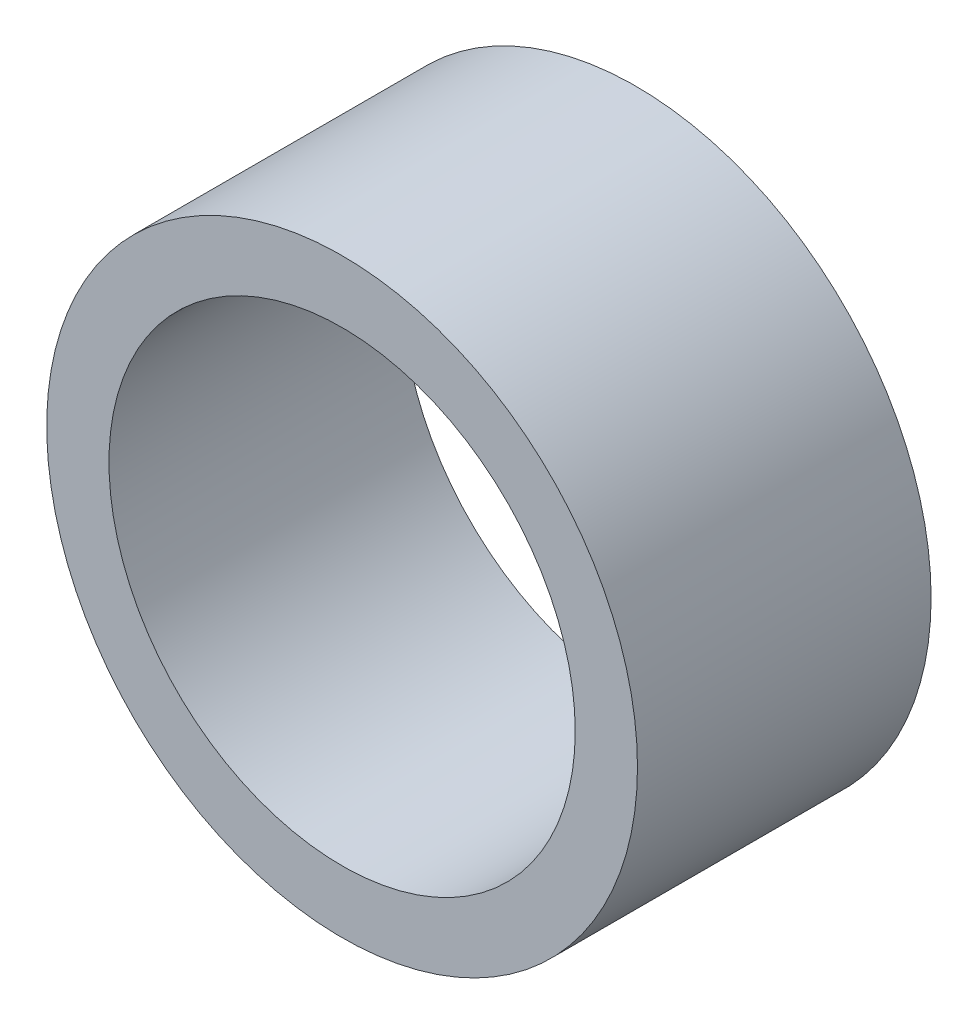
ISO-10303-21;
HEADER;
FILE_DESCRIPTION(('STEP AP214'),'2;1');
FILE_NAME('part.step','',(''),(''),'','','');
FILE_SCHEMA(('AUTOMOTIVE_DESIGN { 1 0 10303 214 1 1 1 1 }'));
ENDSEC;
DATA;
#1=APPLICATION_CONTEXT('core data for automotive mechanical design processes');
#2=APPLICATION_PROTOCOL_DEFINITION('international standard','automotive_design',2000,#1);
#3=PRODUCT_CONTEXT('',#1,'mechanical');
#4=PRODUCT('Part','Part','',(#3));
#5=PRODUCT_RELATED_PRODUCT_CATEGORY('part','',(#4));
#6=PRODUCT_DEFINITION_FORMATION('','',#4);
#7=PRODUCT_DEFINITION_CONTEXT('part definition',#1,'design');
#8=PRODUCT_DEFINITION('design','',#6,#7);
#9=PRODUCT_DEFINITION_SHAPE('','',#8);
#10=(LENGTH_UNIT() NAMED_UNIT(*) SI_UNIT(.MILLI.,.METRE.));
#11=(NAMED_UNIT(*) PLANE_ANGLE_UNIT() SI_UNIT($,.RADIAN.));
#12=(NAMED_UNIT(*) SI_UNIT($,.STERADIAN.) SOLID_ANGLE_UNIT());
#13=UNCERTAINTY_MEASURE_WITH_UNIT(LENGTH_MEASURE(1.E-05),#10,'distance_accuracy_value','');
#14=(GEOMETRIC_REPRESENTATION_CONTEXT(3) GLOBAL_UNCERTAINTY_ASSIGNED_CONTEXT((#13)) GLOBAL_UNIT_ASSIGNED_CONTEXT((#10,
#11,#12)) REPRESENTATION_CONTEXT('',''));
#15=CARTESIAN_POINT('',(0.,0.,0.));
#16=DIRECTION('',(0.,0.,1.));
#17=DIRECTION('',(1.,0.,0.));
#18=AXIS2_PLACEMENT_3D('',#15,#16,#17);
#19=CARTESIAN_POINT('',(0.,0.,961.349421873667));
#20=DIRECTION('',(0.,0.,-1.));
#21=DIRECTION('',(-1.,0.,0.));
#22=AXIS2_PLACEMENT_3D('',#19,#20,#21);
#23=CYLINDRICAL_SURFACE('',#22,251.5);
#24=CARTESIAN_POINT('',(0.,0.,0.));
#25=DIRECTION('',(0.,0.,1.));
#26=DIRECTION('',(1.,0.,0.));
#27=AXIS2_PLACEMENT_3D('',#24,#25,#26);
#28=CIRCLE('',#27,251.5);
#29=CARTESIAN_POINT('',(251.5,0.,0.));
#30=VERTEX_POINT('',#29);
#31=EDGE_CURVE('E46',#30,#30,#28,.T.);
#32=ORIENTED_EDGE('',*,*,#31,.T.);
#33=EDGE_LOOP('',(#32));
#34=FACE_BOUND('',#33,.T.);
#35=CARTESIAN_POINT('',(0.,0.,250.));
#36=DIRECTION('',(0.,0.,1.));
#37=DIRECTION('',(1.,0.,0.));
#38=AXIS2_PLACEMENT_3D('',#35,#36,#37);
#39=CIRCLE('',#38,251.5);
#40=CARTESIAN_POINT('',(251.5,0.,250.));
#41=VERTEX_POINT('',#40);
#42=EDGE_CURVE('E10',#41,#41,#39,.T.);
#43=ORIENTED_EDGE('',*,*,#42,.F.);
#44=EDGE_LOOP('',(#43));
#45=FACE_BOUND('',#44,.T.);
#46=ADVANCED_FACE('F39',(#34,#45),#23,.T.);
#47=CARTESIAN_POINT('',(0.,0.,0.));
#48=DIRECTION('',(0.,0.,1.));
#49=DIRECTION('',(1.,0.,0.));
#50=AXIS2_PLACEMENT_3D('',#47,#48,#49);
#51=PLANE('',#50);
#52=ORIENTED_EDGE('',*,*,#31,.F.);
#53=EDGE_LOOP('',(#52));
#54=FACE_BOUND('',#53,.T.);
#55=CARTESIAN_POINT('',(0.,0.,0.));
#56=DIRECTION('',(0.,0.,1.));
#57=DIRECTION('',(1.,0.,0.));
#58=AXIS2_PLACEMENT_3D('',#55,#56,#57);
#59=CIRCLE('',#58,198.5);
#60=CARTESIAN_POINT('',(198.5,0.,0.));
#61=VERTEX_POINT('',#60);
#62=EDGE_CURVE('E51',#61,#61,#59,.T.);
#63=ORIENTED_EDGE('',*,*,#62,.T.);
#64=EDGE_LOOP('',(#63));
#65=FACE_BOUND('',#64,.T.);
#66=ADVANCED_FACE('F67',(#54,#65),#51,.F.);
#67=CARTESIAN_POINT('',(0.,0.,961.349421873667));
#68=DIRECTION('',(0.,0.,-1.));
#69=DIRECTION('',(-1.,0.,0.));
#70=AXIS2_PLACEMENT_3D('',#67,#68,#69);
#71=CYLINDRICAL_SURFACE('',#70,198.5);
#72=ORIENTED_EDGE('',*,*,#62,.F.);
#73=EDGE_LOOP('',(#72));
#74=FACE_BOUND('',#73,.T.);
#75=CARTESIAN_POINT('',(0.,0.,250.));
#76=DIRECTION('',(0.,0.,1.));
#77=DIRECTION('',(1.,0.,0.));
#78=AXIS2_PLACEMENT_3D('',#75,#76,#77);
#79=CIRCLE('',#78,198.5);
#80=CARTESIAN_POINT('',(198.5,0.,250.));
#81=VERTEX_POINT('',#80);
#82=EDGE_CURVE('E42',#81,#81,#79,.T.);
#83=ORIENTED_EDGE('',*,*,#82,.T.);
#84=EDGE_LOOP('',(#83));
#85=FACE_BOUND('',#84,.T.);
#86=ADVANCED_FACE('F59',(#74,#85),#71,.F.);
#87=CARTESIAN_POINT('',(0.,0.,250.));
#88=DIRECTION('',(0.,0.,1.));
#89=DIRECTION('',(1.,0.,0.));
#90=AXIS2_PLACEMENT_3D('',#87,#88,#89);
#91=PLANE('',#90);
#92=ORIENTED_EDGE('',*,*,#82,.F.);
#93=EDGE_LOOP('',(#92));
#94=FACE_BOUND('',#93,.T.);
#95=ORIENTED_EDGE('',*,*,#42,.T.);
#96=EDGE_LOOP('',(#95));
#97=FACE_BOUND('',#96,.T.);
#98=ADVANCED_FACE('F61',(#94,#97),#91,.T.);
#99=CLOSED_SHELL('',(#46,#66,#86,#98));
#100=MANIFOLD_SOLID_BREP('B2',#99);
#101=ADVANCED_BREP_SHAPE_REPRESENTATION('',(#18,#100),#14);
#102=SHAPE_DEFINITION_REPRESENTATION(#9,#101);
ENDSEC;
END-ISO-10303-21;
